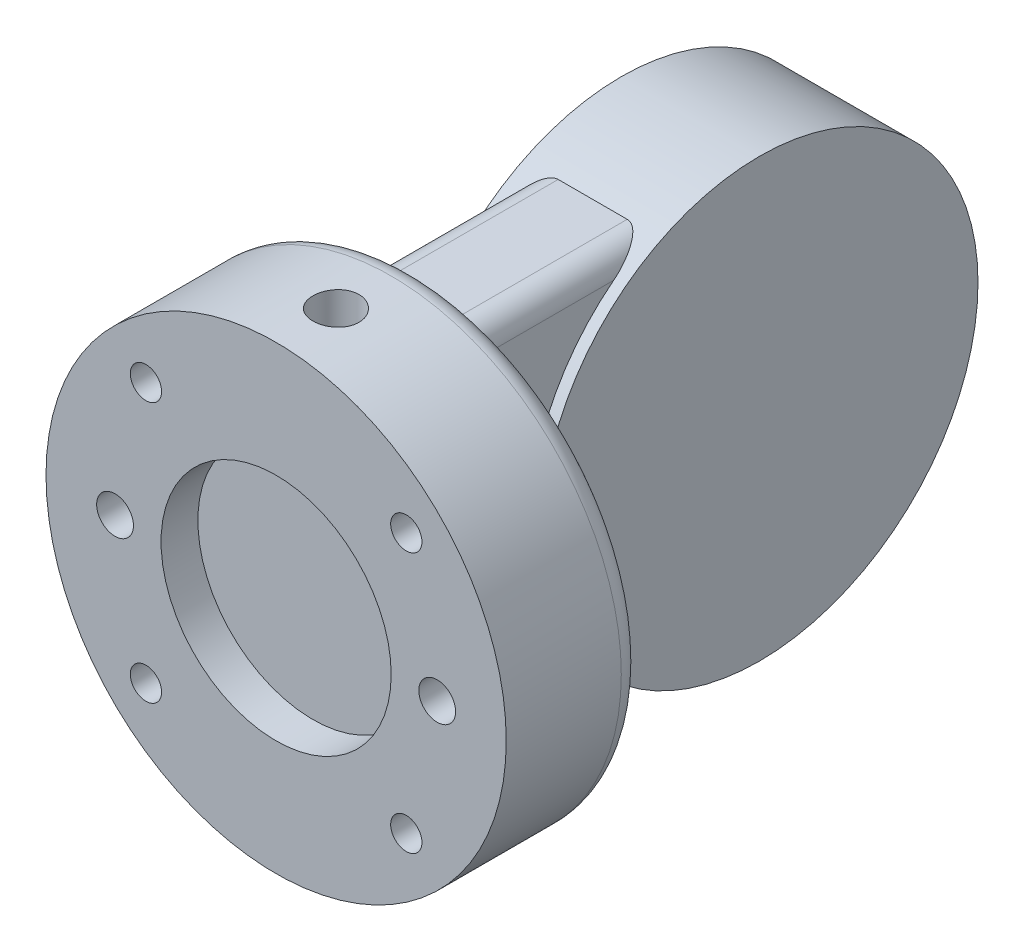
from build123d import *

# Parameters (mm, degrees)
SKETCH_1_R                  = 47.5
EXTRUDE_1_DEPTH             = 15
SKETCH_2_W                  = 90
SKETCH_2_H                  = 85
EXTRUDE_2_DEPTH             = 12.5
SKETCH_3_R                  = 50
EXTRUDE_3_DEPTH             = 30
SKETCH_4_R                  = 25
CUT_EXTRUDE_1_DEPTH         = 8
SKETCH_5_R                  = 4
CUT_EXTRUDE_2_DEPTH         = 15
PATTERN_CIRCULAR_1_COUNT    = 4
HOLE_WIZARD_10_0_10_1_D     = 10
HOLE_WIZARD_10_0_10_1_DEPTH = 20
HOLE_WIZARD_10_0_10_1_TIP   = 3.004303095
FILLET_1_R                  = 5


with BuildPart() as part:
    # Sketch 1 → Extrude 1 (new, symmetric)
    with BuildSketch(Plane(origin=(0, 0, 0), x_dir=(0, 0, -1), z_dir=(1, 0, 0))):
        Circle(SKETCH_1_R)
    extrude(amount=EXTRUDE_1_DEPTH, both=True)

    # Sketch 2 → Extrude 2 (add, symmetric)
    with BuildSketch(Plane(origin=(0, 0, 0), x_dir=(0, 0, -1), z_dir=(1, 0, 0))):
        with Locations((-45, 0)):
            Rectangle(SKETCH_2_W, SKETCH_2_H)
    extrude(amount=EXTRUDE_2_DEPTH, both=True)

    # Sketch 3 → Extrude 3 (add)
    with BuildSketch(Plane.XY.offset(90)):
        Circle(SKETCH_3_R)
    extrude(amount=-EXTRUDE_3_DEPTH)

    # Sketch 4 → Cut-Extrude 1 (cut)
    with BuildSketch(Plane.XY.offset(90)):
        Circle(SKETCH_4_R)
    extrude(amount=-CUT_EXTRUDE_1_DEPTH, mode=Mode.SUBTRACT)

    # Sketch 5 → Cut-Extrude 2 (cut)
    with BuildSketch(Plane.XY.offset(90)):
        with Locations((35, 0)):
            Circle(SKETCH_5_R)
        with Locations((-35, 0)):
            Circle(SKETCH_5_R)
    extrude(amount=-CUT_EXTRUDE_2_DEPTH, mode=Mode.SUBTRACT)

    # Sketch 8 → M8x1.25 _1 (revolve, cut)
    with BuildSketch(Plane(origin=(-28.284271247, 28.284271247, 90), x_dir=(0, -1, 0), z_dir=(1, 0, 0))):
        Polygon((0, 0), (0, 26.042926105), (3.4, 24), (3.4, 0), align=None)
    m8x1_25_1 = revolve(axis=Axis((-28.284271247, 28.284271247, 96.35), (0, 0, -1)), mode=Mode.SUBTRACT)

    # Pattern Circular 1: M8x1.25 _1 ×4 about axis
    pattern_circular_1_axis = Axis((0, 0, 0), (0, 0, 1))
    for i in range(1, PATTERN_CIRCULAR_1_COUNT):
        add(m8x1_25_1.rotate(pattern_circular_1_axis, i * 360 / PATTERN_CIRCULAR_1_COUNT), mode=Mode.SUBTRACT)

    # Hole Wizard 10.0 _10_ _1
    with Locations(Plane(origin=(0, 50, 0), x_dir=(1, 0, 0), z_dir=(0, 1, 0))):
        with Locations((0, -77)):
            Hole(HOLE_WIZARD_10_0_10_1_D / 2, depth=HOLE_WIZARD_10_0_10_1_DEPTH)
            with Locations((0, 0, -(HOLE_WIZARD_10_0_10_1_DEPTH + HOLE_WIZARD_10_0_10_1_TIP / 2))):  # 118° drill point
                Cone(0, HOLE_WIZARD_10_0_10_1_D / 2, HOLE_WIZARD_10_0_10_1_TIP, mode=Mode.SUBTRACT)

    # Fillet 1
    fillet_1_edges = [part.edges().sort_by_distance(p)[0] for p in [
        (12.5, 42.5, 40.606601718),
        (-12.5, -42.5, 40.606601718),
        (12.5, -42.5, 40.606601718),
        (-50, 0, 60),
        (-12.5, 42.5, 40.606601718),
    ]]
    fillet(fillet_1_edges, radius=FILLET_1_R)


solid = part.part
